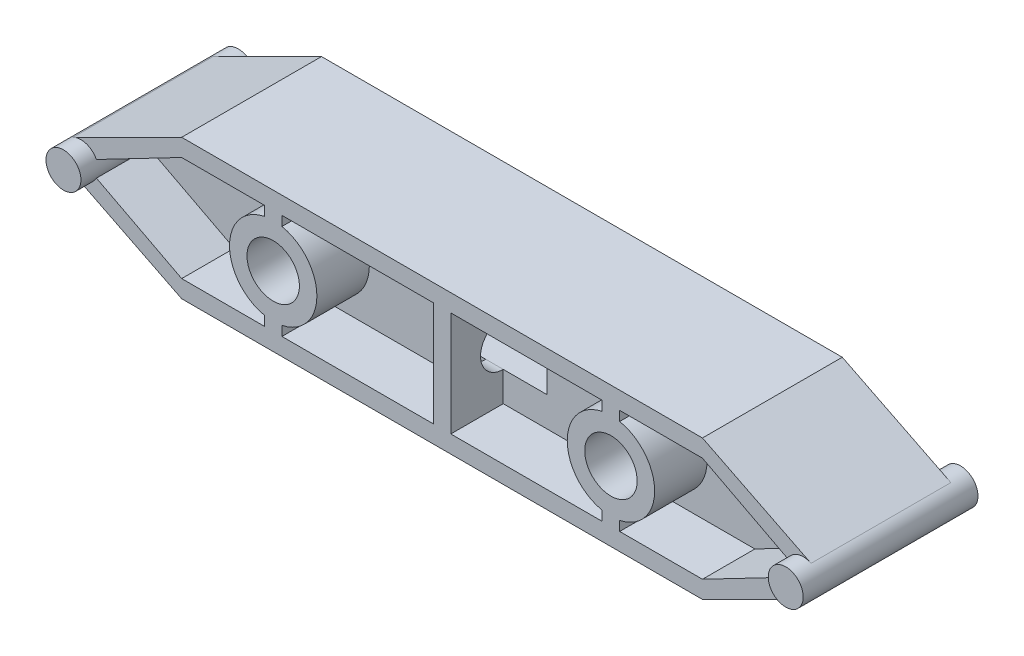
from build123d import *
from build123d.topology import SkipClean

# Parameters (mm, degrees)
SKETCH1_W           = 37.839357
SKETCH1_H           = 5.08
BOSS_EXTRUDE3_DEPTH = 10.16
CUT_EXTRUDE1_DEPTH  = 3.81
BOSS_EXTRUDE4_START = 1.27
SKETCH6_R           = 1.27
BOSS_EXTRUDE4_DEPTH = 1.27
CUT_EXTRUDE2_DEPTH  = 76.492672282
SKETCH9_R           = 1.27
BOSS_EXTRUDE5_DEPTH = 1.27
CUT_EXTRUDE3_START  = -3.81
CUT_EXTRUDE3_DEPTH  = 3.81
SKETCH11_R          = 1.905
CUT_EXTRUDE5_DEPTH  = 74.635096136
BOSS_EXTRUDE6_START = 3.81
SKETCH12_R          = 1.905
SKETCH12_W          = 1.27
SKETCH12_H          = 7.62
BOSS_EXTRUDE6_DEPTH = 3.81
SKETCH13_R          = 1.651
CUT_EXTRUDE6_DEPTH  = 3.81
BOSS_EXTRUDE7_DEPTH = 3.81
SKETCH15_W          = 7.62
SKETCH15_H          = 3.302
CUT_EXTRUDE7_DEPTH  = 10


with BuildPart() as part:
    # Sketch1 → Boss-Extrude3 (new body)
    with BuildSketch(Plane.XY):
        Polygon((-64.473180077, 5.08), (-74.633180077, 0), (-64.473180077, 0), align=None)
        Polygon((-64.473180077, 0), (-74.633180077, 0), (-64.473180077, -5.08), align=None)
        with Locations((-45.553501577, 2.54)):
            Rectangle(SKETCH1_W, SKETCH1_H)
        with Locations((-45.553501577, -2.54)):
            Rectangle(SKETCH1_W, SKETCH1_H)
        Polygon((-16.473823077, 0), (-26.633823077, 0), (-26.633823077, -5.08), align=None)
        Polygon((-26.633823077, 5.08), (-26.633823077, 0), (-16.473823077, 0), align=None)
    extrude(amount=BOSS_EXTRUDE3_DEPTH)

    # Sketch4 → Cut-Extrude1 (cut)
    with BuildSketch(Plane.XY.offset(10.16)):
        with BuildLine():
            Line((-20.440174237, 0.586341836), (-26.633823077, 3.81))
            Line((-26.633823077, 3.81), (-64.473180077, 3.81))
            Line((-64.473180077, 3.81), (-70.666828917, 0.586341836))
            ThreePointArc((-70.666828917, 0.586341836), (-70.559758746, 0.301817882), (-70.523373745, 0))
            ThreePointArc((-70.523373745, 0), (-70.559758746, -0.301817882), (-70.666828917, -0.586341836))
            Line((-70.666828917, -0.586341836), (-64.473180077, -3.81))
            Line((-64.473180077, -3.81), (-26.633823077, -3.81))
            Line((-26.633823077, -3.81), (-20.440174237, -0.586341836))
            ThreePointArc((-20.440174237, -0.586341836), (-20.583629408, 0), (-20.440174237, 0.586341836))
        make_face()
    extrude(amount=-CUT_EXTRUDE1_DEPTH, mode=Mode.SUBTRACT)

    # Sketch6 → Boss-Extrude4 (add)
    with SkipClean():  # the faces are left unmerged after this step: merging them gives an invalid solid
        with BuildSketch(Plane.XY.offset(10.16).offset(BOSS_EXTRUDE4_START)):
            with Locations((-71.793373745, 0)):
                Circle(SKETCH6_R)
            with Locations((-19.313629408, 0)):
                Circle(SKETCH6_R)
        extrude(amount=-BOSS_EXTRUDE4_DEPTH)

    # Sketch7 → Cut-Extrude2 (cut, through all)
    with SkipClean():  # the faces are left unmerged after this step: merging them gives an invalid solid
        with BuildSketch(Plane.XY.offset(10.16)):
            with BuildLine():
                Line((-16.473823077, 0), (-18.745668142, 1.135922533))
                ThreePointArc((-18.745668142, 1.135922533), (-18.043629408, 0), (-18.745668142, -1.135922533))
                Line((-18.745668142, -1.135922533), (-16.473823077, 0))
            make_face()
            with BuildLine():
                Line((-72.361335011, 1.135922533), (-74.633180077, 0))
                Line((-74.633180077, 0), (-72.361335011, -1.135922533))
                ThreePointArc((-72.361335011, -1.135922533), (-73.063373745, 0), (-72.361335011, 1.135922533))
            make_face()
        extrude(amount=-CUT_EXTRUDE2_DEPTH, mode=Mode.SUBTRACT)

    # Sketch9 → Boss-Extrude5 (add)
    with BuildSketch(Plane(origin=(0, 0, 0), x_dir=(-1, 0, 0), z_dir=(0, 0, -1))):
        with Locations(Location((19.313629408, 0, 0), (0, 0, 180))):
            Circle(SKETCH9_R)
        with Locations(Location((71.793373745, 0, 0), (0, 0, 180))):
            Circle(SKETCH9_R)
    extrude(amount=BOSS_EXTRUDE5_DEPTH)

    # Sketch10 → Cut-Extrude3 (cut)
    with SkipClean():  # the faces are left unmerged after this step: merging them gives an invalid solid
        with BuildSketch(Plane(origin=(0, 0, 0), x_dir=(-1, 0, 0), z_dir=(0, 0, -1)).offset(CUT_EXTRUDE3_START)):
            with BuildLine():
                Line((64.473180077, 3.81), (26.633823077, 3.81))
                Line((26.633823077, 3.81), (20.166101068, 0.94137775))
                ThreePointArc((20.166101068, 0.94137775), (20.583629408, 0), (20.166101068, -0.94137775))
                Line((20.166101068, -0.94137775), (26.633823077, -3.81))
                Line((26.633823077, -3.81), (64.473180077, -3.81))
                Line((64.473180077, -3.81), (70.666828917, -0.586341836))
                ThreePointArc((70.666828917, -0.586341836), (70.523373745, 0), (70.666828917, 0.586341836))
                Line((70.666828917, 0.586341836), (64.473180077, 3.81))
            make_face()
        extrude(amount=CUT_EXTRUDE3_DEPTH, mode=Mode.SUBTRACT)

    # Sketch11 → Cut-Extrude5 (cut, through all)
    with SkipClean():  # the faces are left unmerged after this step: merging them gives an invalid solid
        with BuildSketch(Plane.XY.offset(6.35)):
            with Locations((-57.823373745, 0)):
                Circle(SKETCH11_R)
            with Locations((-33.283629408, 0)):
                Circle(SKETCH11_R)
            with BuildLine():
                Line((-49.363501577, 1.651), (-49.363501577, 1.112919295))
                ThreePointArc((-49.363501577, 1.112919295), (-49.031629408, 0), (-49.363501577, -1.112919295))
                Line((-49.363501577, -1.112919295), (-49.363501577, -1.651))
                Line((-49.363501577, -1.651), (-41.743501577, -1.651))
                Line((-41.743501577, -1.651), (-41.743501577, -1.112919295))
                ThreePointArc((-41.743501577, -1.112919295), (-42.075373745, 0), (-41.743501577, 1.112919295))
                Line((-41.743501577, 1.112919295), (-41.743501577, 1.651))
                Line((-41.743501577, 1.651), (-49.363501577, 1.651))
            make_face()
        extrude(amount=-CUT_EXTRUDE5_DEPTH, mode=Mode.SUBTRACT)

    # Sketch12 → Boss-Extrude6 (add)
    # profile 1 of 3: a face of its own
    with SkipClean():  # the faces are left unmerged after this step: merging them gives an invalid solid
        with BuildSketch(Plane.XY.offset(6.35).offset(BOSS_EXTRUDE6_START)):
            with BuildLine():
                Line((-57.188373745, 3.81), (-58.458373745, 3.81))
                Line((-58.458373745, 3.81), (-58.458373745, 3.110851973))
                ThreePointArc((-58.458373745, 3.110851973), (-60.998373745, 0), (-58.458373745, -3.110851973))
                Line((-58.458373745, -3.110851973), (-58.458373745, -3.81))
                Line((-58.458373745, -3.81), (-57.188373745, -3.81))
                Line((-57.188373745, -3.81), (-57.188373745, -3.110851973))
                ThreePointArc((-57.188373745, -3.110851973), (-54.648373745, 0), (-57.188373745, 3.110851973))
                Line((-57.188373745, 3.110851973), (-57.188373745, 3.81))
            make_face()
            with Locations((-57.823373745, 0)):
                Circle(SKETCH12_R, mode=Mode.SUBTRACT)
        # profile 2 of 3: a face of its own
        with BuildSketch(Plane.XY.offset(6.35).offset(BOSS_EXTRUDE6_START)):
            with Locations((-45.553501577, 0)):
                Rectangle(SKETCH12_W, SKETCH12_H)
        # profile 3 of 3: a face of its own
        with BuildSketch(Plane.XY.offset(6.35).offset(BOSS_EXTRUDE6_START)):
            with BuildLine():
                Line((-32.648629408, 3.81), (-33.918629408, 3.81))
                Line((-33.918629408, 3.81), (-33.918629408, 3.110851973))
                ThreePointArc((-33.918629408, 3.110851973), (-36.458629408, 0), (-33.918629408, -3.110851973))
                Line((-33.918629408, -3.110851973), (-33.918629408, -3.81))
                Line((-33.918629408, -3.81), (-32.648629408, -3.81))
                Line((-32.648629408, -3.81), (-32.648629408, -3.110851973))
                ThreePointArc((-32.648629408, -3.110851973), (-30.108629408, 0), (-32.648629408, 3.110851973))
                Line((-32.648629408, 3.110851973), (-32.648629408, 3.81))
            make_face()
            with Locations((-33.283629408, 0)):
                Circle(SKETCH12_R, mode=Mode.SUBTRACT)
        extrude(amount=-BOSS_EXTRUDE6_DEPTH)

    # Sketch13 → Cut-Extrude6 (cut)
    with SkipClean():  # the faces are left unmerged after this step: merging them gives an invalid solid
        with BuildSketch(Plane.ZY.offset(46.188501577)):
            with Locations((6.35, 0)):
                Circle(SKETCH13_R)
        extrude(amount=-CUT_EXTRUDE6_DEPTH, mode=Mode.SUBTRACT)

    # Sketch14 → Boss-Extrude7 (add)
    with SkipClean():  # the faces are left unmerged after this step: merging them gives an invalid solid
        with BuildSketch(Plane(origin=(0, 0, 3.81), x_dir=(-1, 0, 0), z_dir=(0, 0, -1))):
            with BuildLine():
                Line((58.458373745, 3.81), (57.188373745, 3.81))
                Line((57.188373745, 3.81), (57.188373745, 3.110851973))
                ThreePointArc((57.188373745, 3.110851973), (57.823373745, 3.175), (58.458373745, 3.110851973))
                Line((58.458373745, 3.110851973), (58.458373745, 3.81))
            make_face()
            with BuildLine():
                ThreePointArc((58.458373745, 3.110851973), (57.823373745, 3.175), (57.188373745, 3.110851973))
                Line((57.188373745, 3.110851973), (57.188373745, 1.796051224))
                ThreePointArc((57.188373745, 1.796051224), (57.823373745, 1.905), (58.458373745, 1.796051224))
                Line((58.458373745, 1.796051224), (58.458373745, 3.110851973))
            make_face()
            with BuildLine():
                Line((57.188373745, -1.796051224), (57.188373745, -3.110851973))
                ThreePointArc((57.188373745, -3.110851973), (57.823373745, -3.175), (58.458373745, -3.110851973))
                Line((58.458373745, -3.110851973), (58.458373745, -1.796051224))
                ThreePointArc((58.458373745, -1.796051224), (57.823373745, -1.905), (57.188373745, -1.796051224))
            make_face()
            with BuildLine():
                Line((57.188373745, 1.796051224), (57.188373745, 3.110851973))
                ThreePointArc((57.188373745, 3.110851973), (54.648373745, 0), (57.188373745, -3.110851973))
                Line((57.188373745, -3.110851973), (57.188373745, -1.796051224))
                ThreePointArc((57.188373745, -1.796051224), (55.918373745, 0), (57.188373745, 1.796051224))
            make_face()
            with BuildLine():
                ThreePointArc((60.998373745, 0), (60.28271817, 2.008046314), (58.458373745, 3.110851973))
                Line((58.458373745, 3.110851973), (58.458373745, 1.796051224))
                ThreePointArc((58.458373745, 1.796051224), (59.378799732, 1.099852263), (59.728373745, 0))
                ThreePointArc((59.728373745, 0), (59.378799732, -1.099852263), (58.458373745, -1.796051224))
                Line((58.458373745, -1.796051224), (58.458373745, -3.110851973))
                ThreePointArc((58.458373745, -3.110851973), (60.28271817, -2.008046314), (60.998373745, 0))
            make_face()
            with BuildLine():
                ThreePointArc((58.458373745, 3.110851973), (57.823373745, 3.175), (57.188373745, 3.110851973))
                Line((57.188373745, 3.110851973), (57.188373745, 1.796051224))
                ThreePointArc((57.188373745, 1.796051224), (57.823373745, 1.905), (58.458373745, 1.796051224))
                Line((58.458373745, 1.796051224), (58.458373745, 3.110851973))
            make_face()
            with BuildLine():
                Line((57.188373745, -1.796051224), (57.188373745, -3.110851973))
                ThreePointArc((57.188373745, -3.110851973), (57.823373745, -3.175), (58.458373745, -3.110851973))
                Line((58.458373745, -3.110851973), (58.458373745, -1.796051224))
                ThreePointArc((58.458373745, -1.796051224), (57.823373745, -1.905), (57.188373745, -1.796051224))
            make_face()
            with BuildLine():
                ThreePointArc((58.458373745, -3.110851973), (57.823373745, -3.175), (57.188373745, -3.110851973))
                Line((57.188373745, -3.110851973), (57.188373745, -3.81))
                Line((57.188373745, -3.81), (58.458373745, -3.81))
                Line((58.458373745, -3.81), (58.458373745, -3.110851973))
            make_face()
            with BuildLine():
                Line((33.918629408, 3.81), (32.648629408, 3.81))
                Line((32.648629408, 3.81), (32.648629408, 3.110851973))
                ThreePointArc((32.648629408, 3.110851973), (33.283629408, 3.175), (33.918629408, 3.110851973))
                Line((33.918629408, 3.110851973), (33.918629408, 3.81))
            make_face()
            with BuildLine():
                ThreePointArc((33.918629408, 3.110851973), (33.283629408, 3.175), (32.648629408, 3.110851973))
                Line((32.648629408, 3.110851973), (32.648629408, 1.796051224))
                ThreePointArc((32.648629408, 1.796051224), (33.283629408, 1.905), (33.918629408, 1.796051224))
                Line((33.918629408, 1.796051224), (33.918629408, 3.110851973))
            make_face()
            with BuildLine():
                Line((32.648629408, -1.796051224), (32.648629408, -3.110851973))
                ThreePointArc((32.648629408, -3.110851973), (33.283629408, -3.175), (33.918629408, -3.110851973))
                Line((33.918629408, -3.110851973), (33.918629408, -1.796051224))
                ThreePointArc((33.918629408, -1.796051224), (33.283629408, -1.905), (32.648629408, -1.796051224))
            make_face()
            with BuildLine():
                Line((32.648629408, 1.796051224), (32.648629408, 3.110851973))
                ThreePointArc((32.648629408, 3.110851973), (30.108629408, 0), (32.648629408, -3.110851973))
                Line((32.648629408, -3.110851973), (32.648629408, -1.796051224))
                ThreePointArc((32.648629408, -1.796051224), (31.378629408, 0), (32.648629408, 1.796051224))
            make_face()
            with BuildLine():
                ThreePointArc((33.918629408, 3.110851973), (33.283629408, 3.175), (32.648629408, 3.110851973))
                Line((32.648629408, 3.110851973), (32.648629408, 1.796051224))
                ThreePointArc((32.648629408, 1.796051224), (33.283629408, 1.905), (33.918629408, 1.796051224))
                Line((33.918629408, 1.796051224), (33.918629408, 3.110851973))
            make_face()
            with BuildLine():
                Line((32.648629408, -1.796051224), (32.648629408, -3.110851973))
                ThreePointArc((32.648629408, -3.110851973), (33.283629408, -3.175), (33.918629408, -3.110851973))
                Line((33.918629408, -3.110851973), (33.918629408, -1.796051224))
                ThreePointArc((33.918629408, -1.796051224), (33.283629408, -1.905), (32.648629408, -1.796051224))
            make_face()
            with BuildLine():
                ThreePointArc((33.918629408, -3.110851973), (33.283629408, -3.175), (32.648629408, -3.110851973))
                Line((32.648629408, -3.110851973), (32.648629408, -3.81))
                Line((32.648629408, -3.81), (33.918629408, -3.81))
                Line((33.918629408, -3.81), (33.918629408, -3.110851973))
            make_face()
            with BuildLine():
                ThreePointArc((36.458629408, 0), (35.742973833, 2.008046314), (33.918629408, 3.110851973))
                Line((33.918629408, 3.110851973), (33.918629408, 1.796051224))
                ThreePointArc((33.918629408, 1.796051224), (34.839055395, 1.099852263), (35.188629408, 0))
                ThreePointArc((35.188629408, 0), (34.839055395, -1.099852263), (33.918629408, -1.796051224))
                Line((33.918629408, -1.796051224), (33.918629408, -3.110851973))
                ThreePointArc((33.918629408, -3.110851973), (35.742973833, -2.008046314), (36.458629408, 0))
            make_face()
        extrude(amount=BOSS_EXTRUDE7_DEPTH)

    # Sketch15 → Cut-Extrude7 (cut)
    with SkipClean():  # the faces are left unmerged after this step: merging them gives an invalid solid
        with BuildSketch(Plane.XY.offset(6.35)):
            with Locations((-45.553501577, 0)):
                Rectangle(SKETCH15_W, SKETCH15_H)
        extrude(amount=-CUT_EXTRUDE7_DEPTH, mode=Mode.SUBTRACT)


solid = part.part
